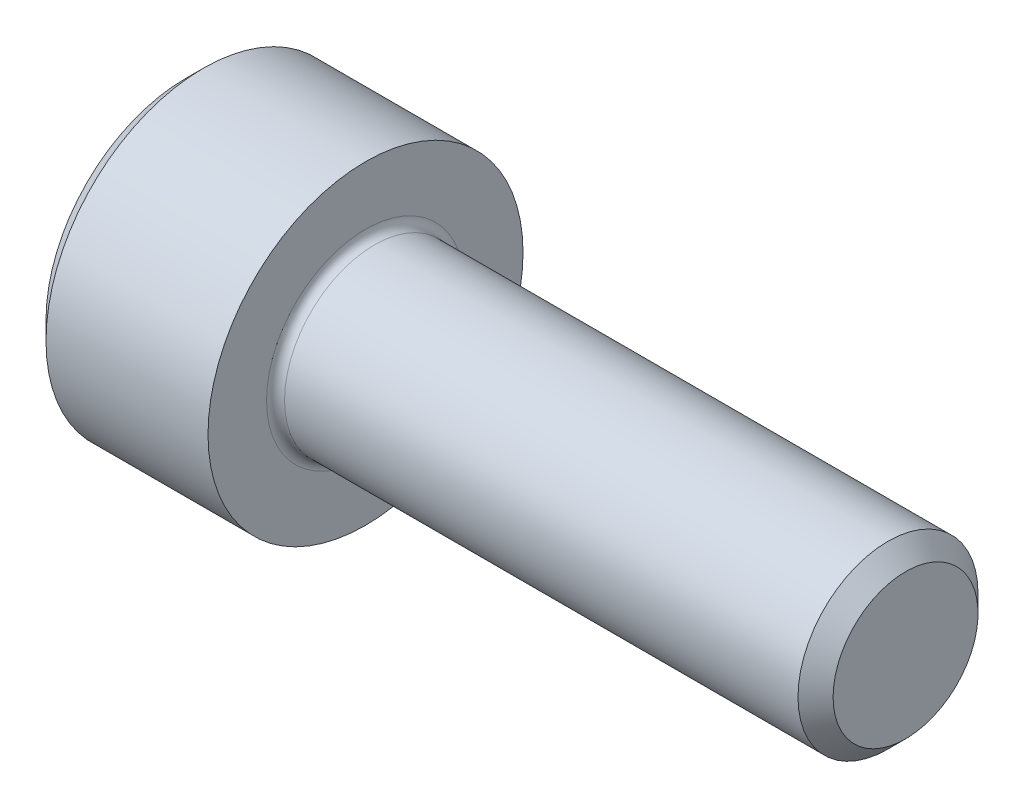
ISO-10303-21;
HEADER;
FILE_DESCRIPTION(('STEP AP214'),'2;1');
FILE_NAME('part.step','',(''),(''),'','','');
FILE_SCHEMA(('AUTOMOTIVE_DESIGN { 1 0 10303 214 1 1 1 1 }'));
ENDSEC;
DATA;
#1=APPLICATION_CONTEXT('core data for automotive mechanical design processes');
#2=APPLICATION_PROTOCOL_DEFINITION('international standard','automotive_design',2000,#1);
#3=PRODUCT_CONTEXT('',#1,'mechanical');
#4=PRODUCT('Part','Part','',(#3));
#5=PRODUCT_RELATED_PRODUCT_CATEGORY('part','',(#4));
#6=PRODUCT_DEFINITION_FORMATION('','',#4);
#7=PRODUCT_DEFINITION_CONTEXT('part definition',#1,'design');
#8=PRODUCT_DEFINITION('design','',#6,#7);
#9=PRODUCT_DEFINITION_SHAPE('','',#8);
#10=(LENGTH_UNIT() NAMED_UNIT(*) SI_UNIT(.MILLI.,.METRE.));
#11=(NAMED_UNIT(*) PLANE_ANGLE_UNIT() SI_UNIT($,.RADIAN.));
#12=(NAMED_UNIT(*) SI_UNIT($,.STERADIAN.) SOLID_ANGLE_UNIT());
#13=UNCERTAINTY_MEASURE_WITH_UNIT(LENGTH_MEASURE(1.E-05),#10,'distance_accuracy_value','');
#14=(GEOMETRIC_REPRESENTATION_CONTEXT(3) GLOBAL_UNCERTAINTY_ASSIGNED_CONTEXT((#13)) GLOBAL_UNIT_ASSIGNED_CONTEXT((#10,
#11,#12)) REPRESENTATION_CONTEXT('',''));
#15=CARTESIAN_POINT('',(0.,0.,0.));
#16=DIRECTION('',(0.,0.,1.));
#17=DIRECTION('',(1.,0.,0.));
#18=AXIS2_PLACEMENT_3D('',#15,#16,#17);
#19=CARTESIAN_POINT('',(0.,0.,0.));
#20=DIRECTION('',(-1.,0.,0.));
#21=DIRECTION('',(0.,0.,1.));
#22=AXIS2_PLACEMENT_3D('',#19,#20,#21);
#23=PLANE('',#22);
#24=DIRECTION('',(0.,-0.499999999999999,0.86602540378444));
#25=VECTOR('',#24,1.);
#26=CARTESIAN_POINT('',(0.,1.77304267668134,0.));
#27=LINE('',#26,#25);
#28=CARTESIAN_POINT('',(0.,1.77304267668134,0.));
#29=VERTEX_POINT('',#28);
#30=CARTESIAN_POINT('',(0.,0.88652133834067,1.5355));
#31=VERTEX_POINT('',#30);
#32=EDGE_CURVE('E388',#29,#31,#27,.T.);
#33=ORIENTED_EDGE('',*,*,#32,.T.);
#34=DIRECTION('',(0.,1.,0.));
#35=VECTOR('',#34,1.);
#36=CARTESIAN_POINT('',(0.,-0.886521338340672,1.5355));
#37=LINE('',#36,#35);
#38=CARTESIAN_POINT('',(0.,-0.886521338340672,1.5355));
#39=VERTEX_POINT('',#38);
#40=EDGE_CURVE('E124',#39,#31,#37,.T.);
#41=ORIENTED_EDGE('',*,*,#40,.F.);
#42=DIRECTION('',(0.,-0.500000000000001,-0.866025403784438));
#43=VECTOR('',#42,1.);
#44=CARTESIAN_POINT('',(0.,-0.886521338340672,1.5355));
#45=LINE('',#44,#43);
#46=CARTESIAN_POINT('',(0.,-1.77304267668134,0.));
#47=VERTEX_POINT('',#46);
#48=EDGE_CURVE('E391',#39,#47,#45,.T.);
#49=ORIENTED_EDGE('',*,*,#48,.T.);
#50=DIRECTION('',(0.,0.499999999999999,-0.86602540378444));
#51=VECTOR('',#50,1.);
#52=CARTESIAN_POINT('',(0.,-1.77304267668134,0.));
#53=LINE('',#52,#51);
#54=CARTESIAN_POINT('',(0.,-0.886521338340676,-1.5355));
#55=VERTEX_POINT('',#54);
#56=EDGE_CURVE('E394',#47,#55,#53,.T.);
#57=ORIENTED_EDGE('',*,*,#56,.T.);
#58=DIRECTION('',(0.,-1.,0.));
#59=VECTOR('',#58,1.);
#60=CARTESIAN_POINT('',(0.,0.886521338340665,-1.5355));
#61=LINE('',#60,#59);
#62=CARTESIAN_POINT('',(0.,0.886521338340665,-1.5355));
#63=VERTEX_POINT('',#62);
#64=EDGE_CURVE('E397',#63,#55,#61,.T.);
#65=ORIENTED_EDGE('',*,*,#64,.F.);
#66=DIRECTION('',(0.,-0.500000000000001,-0.866025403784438));
#67=VECTOR('',#66,1.);
#68=CARTESIAN_POINT('',(0.,1.77304267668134,0.));
#69=LINE('',#68,#67);
#70=EDGE_CURVE('E119',#29,#63,#69,.T.);
#71=ORIENTED_EDGE('',*,*,#70,.F.);
#72=EDGE_LOOP('',(#33,#41,#49,#57,#65,#71));
#73=FACE_BOUND('',#72,.T.);
#74=CARTESIAN_POINT('',(0.,0.,0.));
#75=DIRECTION('',(-1.,0.,0.));
#76=DIRECTION('',(0.,0.,1.));
#77=AXIS2_PLACEMENT_3D('',#74,#75,#76);
#78=CIRCLE('',#77,3.10000000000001);
#79=CARTESIAN_POINT('',(0.,0.,3.10000000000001));
#80=VERTEX_POINT('',#79);
#81=EDGE_CURVE('E135',#80,#80,#78,.T.);
#82=ORIENTED_EDGE('',*,*,#81,.T.);
#83=EDGE_LOOP('',(#82));
#84=FACE_BOUND('',#83,.T.);
#85=ADVANCED_FACE('F32',(#73,#84),#23,.T.);
#86=CARTESIAN_POINT('',(16.,1.61,0.));
#87=DIRECTION('',(1.,0.,0.));
#88=DIRECTION('',(0.,0.,-1.));
#89=AXIS2_PLACEMENT_3D('',#86,#87,#88);
#90=PLANE('',#89);
#91=CARTESIAN_POINT('',(16.,0.,0.));
#92=DIRECTION('',(-1.,0.,0.));
#93=DIRECTION('',(0.,0.,1.));
#94=AXIS2_PLACEMENT_3D('',#91,#92,#93);
#95=CIRCLE('',#94,1.61);
#96=CARTESIAN_POINT('',(16.,0.,1.61));
#97=VERTEX_POINT('',#96);
#98=EDGE_CURVE('E148',#97,#97,#95,.T.);
#99=ORIENTED_EDGE('',*,*,#98,.F.);
#100=EDGE_LOOP('',(#99));
#101=FACE_BOUND('',#100,.T.);
#102=ADVANCED_FACE('F169',(#101),#90,.T.);
#103=CARTESIAN_POINT('',(16.,0.,0.));
#104=DIRECTION('',(-1.,0.,0.));
#105=DIRECTION('',(0.,0.,1.));
#106=AXIS2_PLACEMENT_3D('',#103,#104,#105);
#107=CONICAL_SURFACE('',#106,1.61,0.785398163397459);
#108=CARTESIAN_POINT('',(15.61,0.,0.));
#109=DIRECTION('',(-1.,0.,0.));
#110=DIRECTION('',(0.,0.,1.));
#111=AXIS2_PLACEMENT_3D('',#108,#109,#110);
#112=CIRCLE('',#111,2.);
#113=CARTESIAN_POINT('',(15.61,0.,2.));
#114=VERTEX_POINT('',#113);
#115=EDGE_CURVE('E145',#114,#114,#112,.T.);
#116=ORIENTED_EDGE('',*,*,#115,.F.);
#117=EDGE_LOOP('',(#116));
#118=FACE_BOUND('',#117,.T.);
#119=ORIENTED_EDGE('',*,*,#98,.T.);
#120=EDGE_LOOP('',(#119));
#121=FACE_BOUND('',#120,.T.);
#122=ADVANCED_FACE('F175',(#118,#121),#107,.T.);
#123=CARTESIAN_POINT('',(-31.75,0.,0.));
#124=DIRECTION('',(-1.,0.,0.));
#125=DIRECTION('',(0.,0.,1.));
#126=AXIS2_PLACEMENT_3D('',#123,#124,#125);
#127=CYLINDRICAL_SURFACE('',#126,2.);
#128=CARTESIAN_POINT('',(4.2,0.,0.));
#129=DIRECTION('',(1.,0.,0.));
#130=DIRECTION('',(0.,0.,-1.));
#131=AXIS2_PLACEMENT_3D('',#128,#129,#130);
#132=CIRCLE('',#131,2.);
#133=CARTESIAN_POINT('',(4.2,0.,-2.));
#134=VERTEX_POINT('',#133);
#135=EDGE_CURVE('E11',#134,#134,#132,.T.);
#136=ORIENTED_EDGE('',*,*,#135,.T.);
#137=EDGE_LOOP('',(#136));
#138=FACE_BOUND('',#137,.T.);
#139=ORIENTED_EDGE('',*,*,#115,.T.);
#140=EDGE_LOOP('',(#139));
#141=FACE_BOUND('',#140,.T.);
#142=ADVANCED_FACE('F186',(#138,#141),#127,.T.);
#143=CARTESIAN_POINT('',(4.,3.5,0.));
#144=DIRECTION('',(1.,0.,0.));
#145=DIRECTION('',(0.,0.,-1.));
#146=AXIS2_PLACEMENT_3D('',#143,#144,#145);
#147=PLANE('',#146);
#148=CARTESIAN_POINT('',(4.,0.,0.));
#149=DIRECTION('',(1.,0.,0.));
#150=DIRECTION('',(0.,0.,-1.));
#151=AXIS2_PLACEMENT_3D('',#148,#149,#150);
#152=CIRCLE('',#151,2.2);
#153=CARTESIAN_POINT('',(4.,0.,-2.2));
#154=VERTEX_POINT('',#153);
#155=EDGE_CURVE('E40',#154,#154,#152,.F.);
#156=ORIENTED_EDGE('',*,*,#155,.T.);
#157=EDGE_LOOP('',(#156));
#158=FACE_BOUND('',#157,.T.);
#159=CARTESIAN_POINT('',(4.,0.,0.));
#160=DIRECTION('',(-1.,0.,0.));
#161=DIRECTION('',(0.,0.,1.));
#162=AXIS2_PLACEMENT_3D('',#159,#160,#161);
#163=CIRCLE('',#162,3.5);
#164=CARTESIAN_POINT('',(4.,0.,3.5));
#165=VERTEX_POINT('',#164);
#166=EDGE_CURVE('E142',#165,#165,#163,.T.);
#167=ORIENTED_EDGE('',*,*,#166,.F.);
#168=EDGE_LOOP('',(#167));
#169=FACE_BOUND('',#168,.T.);
#170=ADVANCED_FACE('F153',(#158,#169),#147,.T.);
#171=CARTESIAN_POINT('',(-31.75,0.,0.));
#172=DIRECTION('',(-1.,0.,0.));
#173=DIRECTION('',(0.,0.,1.));
#174=AXIS2_PLACEMENT_3D('',#171,#172,#173);
#175=CYLINDRICAL_SURFACE('',#174,3.5);
#176=ORIENTED_EDGE('',*,*,#166,.T.);
#177=EDGE_LOOP('',(#176));
#178=FACE_BOUND('',#177,.T.);
#179=CARTESIAN_POINT('',(0.399999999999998,0.,0.));
#180=DIRECTION('',(-1.,0.,0.));
#181=DIRECTION('',(0.,0.,1.));
#182=AXIS2_PLACEMENT_3D('',#179,#180,#181);
#183=CIRCLE('',#182,3.5);
#184=CARTESIAN_POINT('',(0.399999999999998,0.,3.5));
#185=VERTEX_POINT('',#184);
#186=EDGE_CURVE('E139',#185,#185,#183,.T.);
#187=ORIENTED_EDGE('',*,*,#186,.F.);
#188=EDGE_LOOP('',(#187));
#189=FACE_BOUND('',#188,.T.);
#190=ADVANCED_FACE('F164',(#178,#189),#175,.T.);
#191=CARTESIAN_POINT('',(0.,0.,0.));
#192=DIRECTION('',(1.,0.,0.));
#193=DIRECTION('',(0.,0.,-1.));
#194=AXIS2_PLACEMENT_3D('',#191,#192,#193);
#195=CONICAL_SURFACE('',#194,3.10000000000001,0.785398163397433);
#196=ORIENTED_EDGE('',*,*,#186,.T.);
#197=EDGE_LOOP('',(#196));
#198=FACE_BOUND('',#197,.T.);
#199=ORIENTED_EDGE('',*,*,#81,.F.);
#200=EDGE_LOOP('',(#199));
#201=FACE_BOUND('',#200,.T.);
#202=ADVANCED_FACE('F157',(#198,#201),#195,.T.);
#203=CARTESIAN_POINT('',(4.2,0.,0.));
#204=DIRECTION('',(1.,0.,0.));
#205=DIRECTION('',(0.,0.,-1.));
#206=AXIS2_PLACEMENT_3D('',#203,#204,#205);
#207=TOROIDAL_SURFACE('',#206,2.2,0.2);
#208=ORIENTED_EDGE('',*,*,#135,.F.);
#209=EDGE_LOOP('',(#208));
#210=FACE_BOUND('',#209,.T.);
#211=ORIENTED_EDGE('',*,*,#155,.F.);
#212=EDGE_LOOP('',(#211));
#213=FACE_BOUND('',#212,.T.);
#214=ADVANCED_FACE('F34',(#210,#213),#207,.F.);
#215=CARTESIAN_POINT('',(2.,1.77304267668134,0.));
#216=DIRECTION('',(0.,-0.86602540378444,-0.499999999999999));
#217=DIRECTION('',(0.,0.499999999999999,-0.86602540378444));
#218=AXIS2_PLACEMENT_3D('',#215,#216,#217);
#219=PLANE('',#218);
#220=ORIENTED_EDGE('',*,*,#32,.F.);
#221=DIRECTION('',(-1.,0.,0.));
#222=VECTOR('',#221,1.);
#223=CARTESIAN_POINT('',(2.,1.77304267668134,0.));
#224=LINE('',#223,#222);
#225=CARTESIAN_POINT('',(2.,1.77304267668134,0.));
#226=VERTEX_POINT('',#225);
#227=EDGE_CURVE('E387',#226,#29,#224,.T.);
#228=ORIENTED_EDGE('',*,*,#227,.F.);
#229=DIRECTION('',(0.,-0.499999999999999,0.86602540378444));
#230=VECTOR('',#229,1.);
#231=CARTESIAN_POINT('',(2.,1.77304267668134,0.));
#232=LINE('',#231,#230);
#233=CARTESIAN_POINT('',(2.,1.32978200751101,0.767749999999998));
#234=VERTEX_POINT('',#233);
#235=EDGE_CURVE('E47',#226,#234,#232,.T.);
#236=ORIENTED_EDGE('',*,*,#235,.T.);
#237=CARTESIAN_POINT('',(2.,0.88652133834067,1.5355));
#238=VERTEX_POINT('',#237);
#239=EDGE_CURVE('E105',#234,#238,#232,.T.);
#240=ORIENTED_EDGE('',*,*,#239,.T.);
#241=DIRECTION('',(-1.,0.,0.));
#242=VECTOR('',#241,1.);
#243=CARTESIAN_POINT('',(2.,0.88652133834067,1.5355));
#244=LINE('',#243,#242);
#245=EDGE_CURVE('E117',#238,#31,#244,.T.);
#246=ORIENTED_EDGE('',*,*,#245,.T.);
#247=EDGE_LOOP('',(#220,#228,#236,#240,#246));
#248=FACE_BOUND('',#247,.T.);
#249=ADVANCED_FACE('F116',(#248),#219,.T.);
#250=CARTESIAN_POINT('',(2.,-0.886521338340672,1.5355));
#251=DIRECTION('',(0.,0.,1.));
#252=DIRECTION('',(0.,-1.,0.));
#253=AXIS2_PLACEMENT_3D('',#250,#251,#252);
#254=PLANE('',#253);
#255=ORIENTED_EDGE('',*,*,#40,.T.);
#256=ORIENTED_EDGE('',*,*,#245,.F.);
#257=DIRECTION('',(0.,1.,0.));
#258=VECTOR('',#257,1.);
#259=CARTESIAN_POINT('',(2.,-0.886521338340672,1.5355));
#260=LINE('',#259,#258);
#261=CARTESIAN_POINT('',(2.,0.,1.5355));
#262=VERTEX_POINT('',#261);
#263=EDGE_CURVE('E103',#262,#238,#260,.T.);
#264=ORIENTED_EDGE('',*,*,#263,.F.);
#265=CARTESIAN_POINT('',(2.,-0.886521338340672,1.5355));
#266=VERTEX_POINT('',#265);
#267=EDGE_CURVE('E113',#266,#262,#260,.T.);
#268=ORIENTED_EDGE('',*,*,#267,.F.);
#269=DIRECTION('',(-1.,0.,0.));
#270=VECTOR('',#269,1.);
#271=CARTESIAN_POINT('',(2.,-0.886521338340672,1.5355));
#272=LINE('',#271,#270);
#273=EDGE_CURVE('E126',#266,#39,#272,.T.);
#274=ORIENTED_EDGE('',*,*,#273,.T.);
#275=EDGE_LOOP('',(#255,#256,#264,#268,#274));
#276=FACE_BOUND('',#275,.T.);
#277=ADVANCED_FACE('F121',(#276),#254,.F.);
#278=CARTESIAN_POINT('',(2.,-0.886521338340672,1.5355));
#279=DIRECTION('',(0.,0.866025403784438,-0.500000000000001));
#280=DIRECTION('',(0.,0.500000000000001,0.866025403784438));
#281=AXIS2_PLACEMENT_3D('',#278,#279,#280);
#282=PLANE('',#281);
#283=ORIENTED_EDGE('',*,*,#48,.F.);
#284=ORIENTED_EDGE('',*,*,#273,.F.);
#285=DIRECTION('',(0.,-0.500000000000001,-0.866025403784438));
#286=VECTOR('',#285,1.);
#287=CARTESIAN_POINT('',(2.,-0.886521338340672,1.5355));
#288=LINE('',#287,#286);
#289=CARTESIAN_POINT('',(2.,-1.32978200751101,0.767750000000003));
#290=VERTEX_POINT('',#289);
#291=EDGE_CURVE('E368',#266,#290,#288,.T.);
#292=ORIENTED_EDGE('',*,*,#291,.T.);
#293=CARTESIAN_POINT('',(2.,-1.77304267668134,0.));
#294=VERTEX_POINT('',#293);
#295=EDGE_CURVE('E370',#290,#294,#288,.T.);
#296=ORIENTED_EDGE('',*,*,#295,.T.);
#297=DIRECTION('',(-1.,0.,0.));
#298=VECTOR('',#297,1.);
#299=CARTESIAN_POINT('',(2.,-1.77304267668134,0.));
#300=LINE('',#299,#298);
#301=EDGE_CURVE('E131',#294,#47,#300,.T.);
#302=ORIENTED_EDGE('',*,*,#301,.T.);
#303=EDGE_LOOP('',(#283,#284,#292,#296,#302));
#304=FACE_BOUND('',#303,.T.);
#305=ADVANCED_FACE('F260',(#304),#282,.T.);
#306=CARTESIAN_POINT('',(2.,-1.77304267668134,0.));
#307=DIRECTION('',(0.,0.86602540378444,0.499999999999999));
#308=DIRECTION('',(0.,-0.499999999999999,0.86602540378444));
#309=AXIS2_PLACEMENT_3D('',#306,#307,#308);
#310=PLANE('',#309);
#311=ORIENTED_EDGE('',*,*,#56,.F.);
#312=ORIENTED_EDGE('',*,*,#301,.F.);
#313=DIRECTION('',(0.,0.499999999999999,-0.86602540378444));
#314=VECTOR('',#313,1.);
#315=CARTESIAN_POINT('',(2.,-1.77304267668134,0.));
#316=LINE('',#315,#314);
#317=CARTESIAN_POINT('',(2.,-1.32978200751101,-0.76775));
#318=VERTEX_POINT('',#317);
#319=EDGE_CURVE('E373',#294,#318,#316,.T.);
#320=ORIENTED_EDGE('',*,*,#319,.T.);
#321=CARTESIAN_POINT('',(2.,-0.886521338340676,-1.5355));
#322=VERTEX_POINT('',#321);
#323=EDGE_CURVE('E377',#318,#322,#316,.T.);
#324=ORIENTED_EDGE('',*,*,#323,.T.);
#325=DIRECTION('',(-1.,0.,0.));
#326=VECTOR('',#325,1.);
#327=CARTESIAN_POINT('',(2.,-0.886521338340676,-1.5355));
#328=LINE('',#327,#326);
#329=EDGE_CURVE('E406',#322,#55,#328,.T.);
#330=ORIENTED_EDGE('',*,*,#329,.T.);
#331=EDGE_LOOP('',(#311,#312,#320,#324,#330));
#332=FACE_BOUND('',#331,.T.);
#333=ADVANCED_FACE('F268',(#332),#310,.T.);
#334=CARTESIAN_POINT('',(2.,0.886521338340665,-1.5355));
#335=DIRECTION('',(0.,0.,-1.));
#336=DIRECTION('',(0.,1.,0.));
#337=AXIS2_PLACEMENT_3D('',#334,#335,#336);
#338=PLANE('',#337);
#339=ORIENTED_EDGE('',*,*,#64,.T.);
#340=ORIENTED_EDGE('',*,*,#329,.F.);
#341=DIRECTION('',(0.,-1.,0.));
#342=VECTOR('',#341,1.);
#343=CARTESIAN_POINT('',(2.,0.886521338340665,-1.5355));
#344=LINE('',#343,#342);
#345=CARTESIAN_POINT('',(2.,0.,-1.5355));
#346=VERTEX_POINT('',#345);
#347=EDGE_CURVE('E381',#346,#322,#344,.T.);
#348=ORIENTED_EDGE('',*,*,#347,.F.);
#349=CARTESIAN_POINT('',(2.,0.886521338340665,-1.5355));
#350=VERTEX_POINT('',#349);
#351=EDGE_CURVE('E382',#350,#346,#344,.T.);
#352=ORIENTED_EDGE('',*,*,#351,.F.);
#353=DIRECTION('',(-1.,0.,0.));
#354=VECTOR('',#353,1.);
#355=CARTESIAN_POINT('',(2.,0.886521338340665,-1.5355));
#356=LINE('',#355,#354);
#357=EDGE_CURVE('E403',#350,#63,#356,.T.);
#358=ORIENTED_EDGE('',*,*,#357,.T.);
#359=EDGE_LOOP('',(#339,#340,#348,#352,#358));
#360=FACE_BOUND('',#359,.T.);
#361=ADVANCED_FACE('F277',(#360),#338,.F.);
#362=CARTESIAN_POINT('',(2.,1.77304267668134,0.));
#363=DIRECTION('',(0.,0.866025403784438,-0.500000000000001));
#364=DIRECTION('',(0.,0.500000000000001,0.866025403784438));
#365=AXIS2_PLACEMENT_3D('',#362,#363,#364);
#366=PLANE('',#365);
#367=ORIENTED_EDGE('',*,*,#70,.T.);
#368=ORIENTED_EDGE('',*,*,#357,.F.);
#369=DIRECTION('',(0.,-0.500000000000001,-0.866025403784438));
#370=VECTOR('',#369,1.);
#371=CARTESIAN_POINT('',(2.,1.77304267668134,0.));
#372=LINE('',#371,#370);
#373=CARTESIAN_POINT('',(2.,1.329782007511,-0.767750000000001));
#374=VERTEX_POINT('',#373);
#375=EDGE_CURVE('E385',#374,#350,#372,.T.);
#376=ORIENTED_EDGE('',*,*,#375,.F.);
#377=EDGE_CURVE('E359',#226,#374,#372,.T.);
#378=ORIENTED_EDGE('',*,*,#377,.F.);
#379=ORIENTED_EDGE('',*,*,#227,.T.);
#380=EDGE_LOOP('',(#367,#368,#376,#378,#379));
#381=FACE_BOUND('',#380,.T.);
#382=ADVANCED_FACE('F286',(#381),#366,.F.);
#383=CARTESIAN_POINT('',(2.,0.886521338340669,1.5355));
#384=DIRECTION('',(-1.,0.,0.));
#385=DIRECTION('',(0.,0.,1.));
#386=AXIS2_PLACEMENT_3D('',#383,#384,#385);
#387=PLANE('',#386);
#388=CARTESIAN_POINT('',(2.,0.,0.));
#389=DIRECTION('',(-1.,0.,0.));
#390=DIRECTION('',(0.,0.,1.));
#391=AXIS2_PLACEMENT_3D('',#388,#389,#390);
#392=CIRCLE('',#391,1.5355);
#393=EDGE_CURVE('E125',#290,#262,#392,.T.);
#394=ORIENTED_EDGE('',*,*,#393,.F.);
#395=ORIENTED_EDGE('',*,*,#291,.F.);
#396=ORIENTED_EDGE('',*,*,#267,.T.);
#397=EDGE_LOOP('',(#394,#395,#396));
#398=FACE_BOUND('',#397,.T.);
#399=ADVANCED_FACE('F295',(#398),#387,.T.);
#400=EDGE_CURVE('E129',#318,#290,#392,.T.);
#401=ORIENTED_EDGE('',*,*,#400,.F.);
#402=ORIENTED_EDGE('',*,*,#319,.F.);
#403=ORIENTED_EDGE('',*,*,#295,.F.);
#404=EDGE_LOOP('',(#401,#402,#403));
#405=FACE_BOUND('',#404,.T.);
#406=ADVANCED_FACE('F304',(#405),#387,.T.);
#407=EDGE_CURVE('E412',#346,#318,#392,.T.);
#408=ORIENTED_EDGE('',*,*,#407,.F.);
#409=ORIENTED_EDGE('',*,*,#347,.T.);
#410=ORIENTED_EDGE('',*,*,#323,.F.);
#411=EDGE_LOOP('',(#408,#409,#410));
#412=FACE_BOUND('',#411,.T.);
#413=ADVANCED_FACE('F313',(#412),#387,.T.);
#414=EDGE_CURVE('E362',#374,#346,#392,.T.);
#415=ORIENTED_EDGE('',*,*,#414,.F.);
#416=ORIENTED_EDGE('',*,*,#375,.T.);
#417=ORIENTED_EDGE('',*,*,#351,.T.);
#418=EDGE_LOOP('',(#415,#416,#417));
#419=FACE_BOUND('',#418,.T.);
#420=ADVANCED_FACE('F321',(#419),#387,.T.);
#421=EDGE_CURVE('E136',#234,#374,#392,.T.);
#422=ORIENTED_EDGE('',*,*,#421,.F.);
#423=ORIENTED_EDGE('',*,*,#235,.F.);
#424=ORIENTED_EDGE('',*,*,#377,.T.);
#425=EDGE_LOOP('',(#422,#423,#424));
#426=FACE_BOUND('',#425,.T.);
#427=ADVANCED_FACE('F329',(#426),#387,.T.);
#428=EDGE_CURVE('E108',#262,#234,#392,.T.);
#429=ORIENTED_EDGE('',*,*,#428,.F.);
#430=ORIENTED_EDGE('',*,*,#263,.T.);
#431=ORIENTED_EDGE('',*,*,#239,.F.);
#432=EDGE_LOOP('',(#429,#430,#431));
#433=FACE_BOUND('',#432,.T.);
#434=ADVANCED_FACE('F104',(#433),#387,.T.);
#435=CARTESIAN_POINT('',(2.,0.,0.));
#436=DIRECTION('',(-1.,0.,0.));
#437=DIRECTION('',(0.,0.,1.));
#438=AXIS2_PLACEMENT_3D('',#435,#436,#437);
#439=CONICAL_SURFACE('',#438,1.5355,1.04719755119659);
#440=CARTESIAN_POINT('',(2.88652133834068,0.,0.));
#441=VERTEX_POINT('',#440);
#442=VERTEX_LOOP('',#441);
#443=FACE_BOUND('',#442,.T.);
#444=ORIENTED_EDGE('',*,*,#428,.T.);
#445=ORIENTED_EDGE('',*,*,#421,.T.);
#446=ORIENTED_EDGE('',*,*,#414,.T.);
#447=ORIENTED_EDGE('',*,*,#407,.T.);
#448=ORIENTED_EDGE('',*,*,#400,.T.);
#449=ORIENTED_EDGE('',*,*,#393,.T.);
#450=EDGE_LOOP('',(#444,#445,#446,#447,#448,#449));
#451=FACE_BOUND('',#450,.T.);
#452=ADVANCED_FACE('F179',(#443,#451),#439,.F.);
#453=CLOSED_SHELL('',(#85,#102,#122,#142,#170,#190,#202,#214,#249,#277,#305,#333,#361,#382,#399,
#406,#413,#420,#427,#434,#452));
#454=MANIFOLD_SOLID_BREP('B2',#453);
#455=ADVANCED_BREP_SHAPE_REPRESENTATION('',(#18,#454),#14);
#456=SHAPE_DEFINITION_REPRESENTATION(#9,#455);
ENDSEC;
END-ISO-10303-21;
